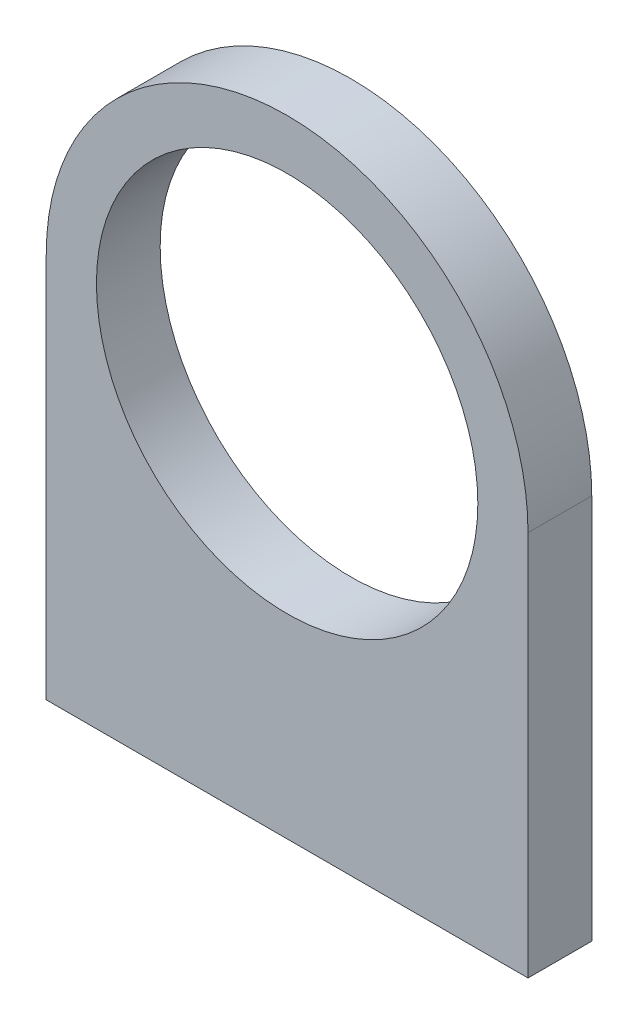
from build123d import *

# Parameters (mm, degrees)
SKETCH1_R           = 19
BOSS_EXTRUDE1_DEPTH = 6.35


with BuildPart() as part:
    # Sketch1 → Boss-Extrude1 (new body)
    with BuildSketch(Plane.XY):
        with BuildLine():
            Line((0, 0), (48, 0))
            Line((48, 0), (48, 38.425))
            ThreePointArc((48, 38.425), (24, 62.425), (0, 38.425))
            Line((0, 38.425), (0, 0))
        make_face()
        with Locations((24, 38.425)):
            Circle(SKETCH1_R, mode=Mode.SUBTRACT)
    extrude(amount=BOSS_EXTRUDE1_DEPTH)


solid = part.part
